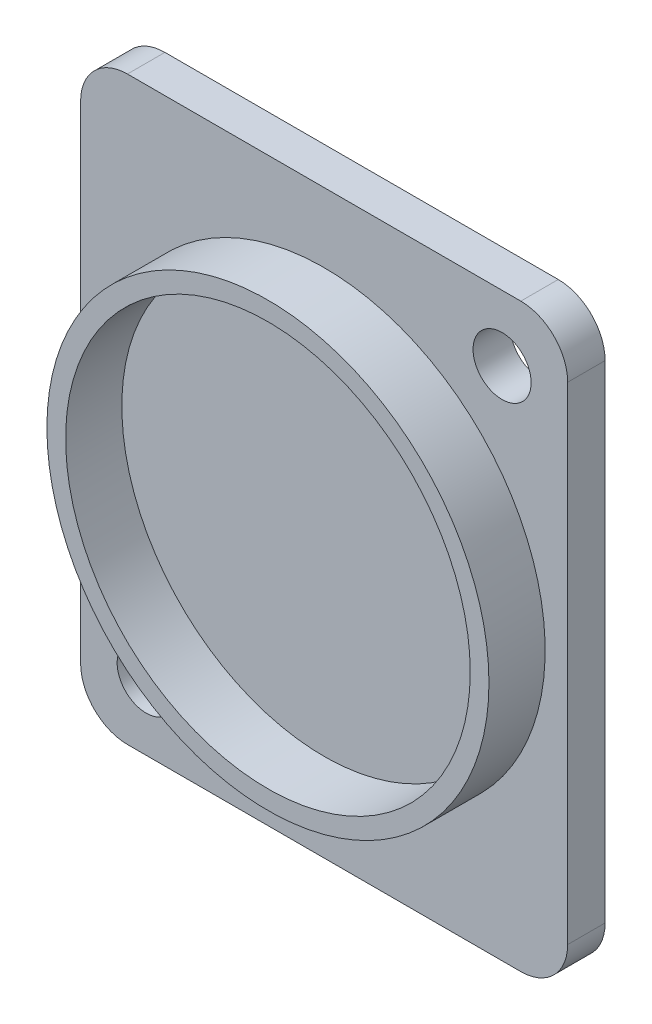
from build123d import *

# Parameters (mm, degrees)
SKETCH1_R           = 1.55
BOSS_EXTRUDE1_DEPTH = 2
SKETCH2_R           = 11.8
SKETCH2_R_2         = 10.8
BOSS_EXTRUDE2_DEPTH = 3


with BuildPart() as part:
    # Sketch1 → Boss-Extrude1 (new body)
    with BuildSketch(Plane.XY):
        with BuildLine():
            Line((10.5, -15.5), (-10.5, -15.5))
            ThreePointArc((-10.5, -15.5), (-12.267766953, -14.767766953), (-13, -13))
            Line((-13, -13), (-13, 13))
            ThreePointArc((-13, 13), (-12.267766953, 14.767766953), (-10.5, 15.5))
            Line((-10.5, 15.5), (10.5, 15.5))
            ThreePointArc((10.5, 15.5), (12.267766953, 14.767766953), (13, 13))
            Line((13, 13), (13, -13))
            ThreePointArc((13, -13), (12.267766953, -14.767766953), (10.5, -15.5))
        make_face()
        with Locations((9.5, 12)):
            Circle(SKETCH1_R, mode=Mode.SUBTRACT)
        with Locations((-9.5, -12)):
            Circle(SKETCH1_R, mode=Mode.SUBTRACT)
    extrude(amount=BOSS_EXTRUDE1_DEPTH)

    # Sketch2 → Boss-Extrude2 (add)
    with BuildSketch(Plane.XY.offset(2)):
        with Locations(Location((0, 0, 0), (0, 0, 180))):
            Circle(SKETCH2_R)
        Circle(SKETCH2_R_2, mode=Mode.SUBTRACT)
    extrude(amount=BOSS_EXTRUDE2_DEPTH)


solid = part.part
